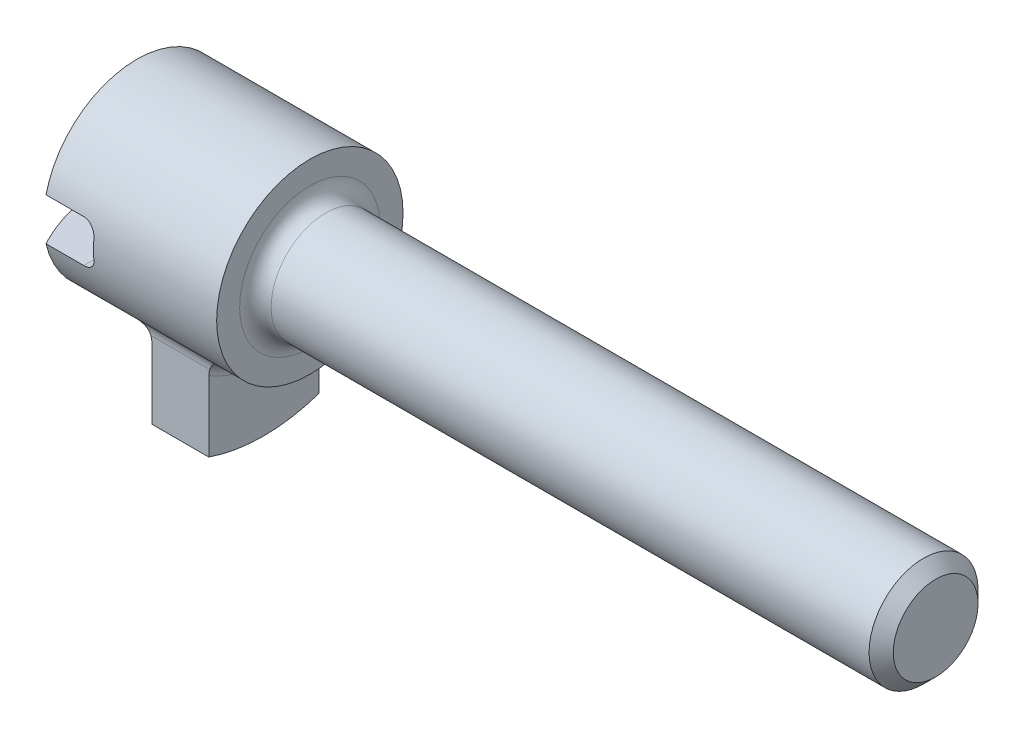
ISO-10303-21;
HEADER;
FILE_DESCRIPTION(('STEP AP214'),'2;1');
FILE_NAME('part.step','',(''),(''),'','','');
FILE_SCHEMA(('AUTOMOTIVE_DESIGN { 1 0 10303 214 1 1 1 1 }'));
ENDSEC;
DATA;
#1=APPLICATION_CONTEXT('core data for automotive mechanical design processes');
#2=APPLICATION_PROTOCOL_DEFINITION('international standard','automotive_design',2000,#1);
#3=PRODUCT_CONTEXT('',#1,'mechanical');
#4=PRODUCT('Part','Part','',(#3));
#5=PRODUCT_RELATED_PRODUCT_CATEGORY('part','',(#4));
#6=PRODUCT_DEFINITION_FORMATION('','',#4);
#7=PRODUCT_DEFINITION_CONTEXT('part definition',#1,'design');
#8=PRODUCT_DEFINITION('design','',#6,#7);
#9=PRODUCT_DEFINITION_SHAPE('','',#8);
#10=(LENGTH_UNIT() NAMED_UNIT(*) SI_UNIT(.MILLI.,.METRE.));
#11=(NAMED_UNIT(*) PLANE_ANGLE_UNIT() SI_UNIT($,.RADIAN.));
#12=(NAMED_UNIT(*) SI_UNIT($,.STERADIAN.) SOLID_ANGLE_UNIT());
#13=UNCERTAINTY_MEASURE_WITH_UNIT(LENGTH_MEASURE(1.E-05),#10,'distance_accuracy_value','');
#14=(GEOMETRIC_REPRESENTATION_CONTEXT(3) GLOBAL_UNCERTAINTY_ASSIGNED_CONTEXT((#13)) GLOBAL_UNIT_ASSIGNED_CONTEXT((#10,
#11,#12)) REPRESENTATION_CONTEXT('',''));
#15=CARTESIAN_POINT('',(0.,0.,0.));
#16=DIRECTION('',(0.,0.,1.));
#17=DIRECTION('',(1.,0.,0.));
#18=AXIS2_PLACEMENT_3D('',#15,#16,#17);
#19=CARTESIAN_POINT('',(1.4732,0.,1.1557));
#20=DIRECTION('',(1.,0.,0.));
#21=DIRECTION('',(0.,1.,0.));
#22=AXIS2_PLACEMENT_3D('',#19,#20,#21);
#23=PLANE('',#22);
#24=DIRECTION('',(0.,-1.,0.));
#25=VECTOR('',#24,1.);
#26=CARTESIAN_POINT('',(1.4732,0.,1.1557));
#27=LINE('',#26,#25);
#28=CARTESIAN_POINT('',(1.4732,-1.88350034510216,1.1557));
#29=VERTEX_POINT('',#28);
#30=CARTESIAN_POINT('',(1.4732,-3.36295904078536,1.1557));
#31=VERTEX_POINT('',#30);
#32=EDGE_CURVE('E137',#29,#31,#27,.T.);
#33=ORIENTED_EDGE('',*,*,#32,.F.);
#34=CARTESIAN_POINT('',(1.4732,0.,0.));
#35=DIRECTION('',(1.,0.,0.));
#36=DIRECTION('',(0.,1.,0.));
#37=AXIS2_PLACEMENT_3D('',#34,#35,#36);
#38=CIRCLE('',#37,2.20979999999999);
#39=CARTESIAN_POINT('',(1.4732,-1.88350034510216,-1.1557));
#40=VERTEX_POINT('',#39);
#41=EDGE_CURVE('E181',#29,#40,#38,.T.);
#42=ORIENTED_EDGE('',*,*,#41,.T.);
#43=DIRECTION('',(0.,-1.,0.));
#44=VECTOR('',#43,1.);
#45=CARTESIAN_POINT('',(1.4732,0.,-1.1557));
#46=LINE('',#45,#44);
#47=CARTESIAN_POINT('',(1.4732,-3.36295904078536,-1.1557));
#48=VERTEX_POINT('',#47);
#49=EDGE_CURVE('E154',#40,#48,#46,.T.);
#50=ORIENTED_EDGE('',*,*,#49,.T.);
#51=CARTESIAN_POINT('',(1.4732,0.,0.));
#52=DIRECTION('',(-1.,0.,0.));
#53=DIRECTION('',(0.,-1.,0.));
#54=AXIS2_PLACEMENT_3D('',#51,#52,#53);
#55=CIRCLE('',#54,3.556);
#56=EDGE_CURVE('E152',#48,#31,#55,.T.);
#57=ORIENTED_EDGE('',*,*,#56,.T.);
#58=EDGE_LOOP('',(#33,#42,#50,#57));
#59=FACE_BOUND('',#58,.T.);
#60=ADVANCED_FACE('F32',(#59),#23,.F.);
#61=CARTESIAN_POINT('',(2.667,-3.556,1.1557));
#62=DIRECTION('',(-1.,0.,0.));
#63=DIRECTION('',(0.,0.,1.));
#64=AXIS2_PLACEMENT_3D('',#61,#62,#63);
#65=PLANE('',#64);
#66=DIRECTION('',(0.,1.,0.));
#67=VECTOR('',#66,1.);
#68=CARTESIAN_POINT('',(2.667,-3.556,-1.1557));
#69=LINE('',#68,#67);
#70=CARTESIAN_POINT('',(2.667,-3.36295904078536,-1.1557));
#71=VERTEX_POINT('',#70);
#72=CARTESIAN_POINT('',(2.667,-1.88350034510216,-1.1557));
#73=VERTEX_POINT('',#72);
#74=EDGE_CURVE('E149',#71,#73,#69,.T.);
#75=ORIENTED_EDGE('',*,*,#74,.T.);
#76=CARTESIAN_POINT('',(2.667,0.,0.));
#77=DIRECTION('',(-1.,0.,0.));
#78=DIRECTION('',(0.,0.,1.));
#79=AXIS2_PLACEMENT_3D('',#76,#77,#78);
#80=CIRCLE('',#79,2.20979999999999);
#81=CARTESIAN_POINT('',(2.667,-1.88350034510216,1.1557));
#82=VERTEX_POINT('',#81);
#83=EDGE_CURVE('E179',#73,#82,#80,.T.);
#84=ORIENTED_EDGE('',*,*,#83,.T.);
#85=DIRECTION('',(0.,1.,0.));
#86=VECTOR('',#85,1.);
#87=CARTESIAN_POINT('',(2.667,-3.556,1.1557));
#88=LINE('',#87,#86);
#89=CARTESIAN_POINT('',(2.667,-3.36295904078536,1.1557));
#90=VERTEX_POINT('',#89);
#91=EDGE_CURVE('E148',#90,#82,#88,.T.);
#92=ORIENTED_EDGE('',*,*,#91,.F.);
#93=CARTESIAN_POINT('',(2.667,0.,0.));
#94=DIRECTION('',(-1.,0.,0.));
#95=DIRECTION('',(0.,0.,1.));
#96=AXIS2_PLACEMENT_3D('',#93,#94,#95);
#97=CIRCLE('',#96,3.556);
#98=EDGE_CURVE('E157',#71,#90,#97,.T.);
#99=ORIENTED_EDGE('',*,*,#98,.F.);
#100=EDGE_LOOP('',(#75,#84,#92,#99));
#101=FACE_BOUND('',#100,.T.);
#102=ADVANCED_FACE('F231',(#101),#65,.F.);
#103=CARTESIAN_POINT('',(1.4732,0.,1.1557));
#104=DIRECTION('',(0.,0.,1.));
#105=DIRECTION('',(1.,0.,0.));
#106=AXIS2_PLACEMENT_3D('',#103,#104,#105);
#107=PLANE('',#106);
#108=ORIENTED_EDGE('',*,*,#91,.T.);
#109=CARTESIAN_POINT('',(2.667,-1.88350034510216,1.1557));
#110=CARTESIAN_POINT('',(2.6670296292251,-1.86232699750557,1.1557));
#111=CARTESIAN_POINT('',(2.66889647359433,-1.84148543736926,1.1557));
#112=CARTESIAN_POINT('',(2.67630402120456,-1.80046905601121,1.1557));
#113=CARTESIAN_POINT('',(2.68184415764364,-1.78029413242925,1.1557));
#114=CARTESIAN_POINT('',(2.68922094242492,-1.76045089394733,1.1557));
#115=B_SPLINE_CURVE_WITH_KNOTS('',3,(#109,#110,#111,#112,#113,#114),.UNSPECIFIED.,.F.,.F.,(4,2,
4),(0.,0.0627750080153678,0.125540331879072),.UNSPECIFIED.);
#116=CARTESIAN_POINT('',(2.68922094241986,-1.76045089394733,1.1557));
#117=VERTEX_POINT('',#116);
#118=EDGE_CURVE('E235',#82,#117,#115,.T.);
#119=ORIENTED_EDGE('',*,*,#118,.T.);
#120=DIRECTION('',(1.,0.,0.));
#121=VECTOR('',#120,1.);
#122=CARTESIAN_POINT('',(1.4732,-1.76045089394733,1.1557));
#123=LINE('',#122,#121);
#124=CARTESIAN_POINT('',(1.45097905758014,-1.76045089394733,1.1557));
#125=VERTEX_POINT('',#124);
#126=EDGE_CURVE('E59',#117,#125,#123,.F.);
#127=ORIENTED_EDGE('',*,*,#126,.T.);
#128=CARTESIAN_POINT('',(1.45097905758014,-1.76045089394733,1.1557));
#129=CARTESIAN_POINT('',(1.45835584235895,-1.78029413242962,1.1557));
#130=CARTESIAN_POINT('',(1.46389597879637,-1.80046905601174,1.1557));
#131=CARTESIAN_POINT('',(1.47130352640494,-1.84148543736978,1.1557));
#132=CARTESIAN_POINT('',(1.47317037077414,-1.86232699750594,1.1557));
#133=CARTESIAN_POINT('',(1.4732,-1.88350034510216,1.1557));
#134=B_SPLINE_CURVE_WITH_KNOTS('',3,(#128,#129,#130,#131,#132,#133),.UNSPECIFIED.,.F.,.F.,(4,2,
4),(0.,0.0627653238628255,0.125540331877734),.UNSPECIFIED.);
#135=EDGE_CURVE('E145',#125,#29,#134,.T.);
#136=ORIENTED_EDGE('',*,*,#135,.T.);
#137=ORIENTED_EDGE('',*,*,#32,.T.);
#138=DIRECTION('',(-1.,0.,0.));
#139=VECTOR('',#138,1.);
#140=CARTESIAN_POINT('',(16.764,-3.36295904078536,1.1557));
#141=LINE('',#140,#139);
#142=EDGE_CURVE('E142',#31,#90,#141,.F.);
#143=ORIENTED_EDGE('',*,*,#142,.T.);
#144=EDGE_LOOP('',(#108,#119,#127,#136,#137,#143));
#145=FACE_BOUND('',#144,.T.);
#146=ADVANCED_FACE('F140',(#145),#107,.T.);
#147=CARTESIAN_POINT('',(1.4732,0.,-1.1557));
#148=DIRECTION('',(0.,0.,1.));
#149=DIRECTION('',(1.,0.,0.));
#150=AXIS2_PLACEMENT_3D('',#147,#148,#149);
#151=PLANE('',#150);
#152=ORIENTED_EDGE('',*,*,#49,.F.);
#153=CARTESIAN_POINT('',(1.4732,-1.88350034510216,-1.1557));
#154=CARTESIAN_POINT('',(1.4731703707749,-1.86232699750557,-1.1557));
#155=CARTESIAN_POINT('',(1.47130352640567,-1.84148543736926,-1.1557));
#156=CARTESIAN_POINT('',(1.46389597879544,-1.80046905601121,-1.1557));
#157=CARTESIAN_POINT('',(1.45835584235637,-1.78029413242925,-1.1557));
#158=CARTESIAN_POINT('',(1.45097905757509,-1.76045089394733,-1.1557));
#159=B_SPLINE_CURVE_WITH_KNOTS('',3,(#153,#154,#155,#156,#157,#158),.UNSPECIFIED.,.F.,.F.,(4,2,
4),(0.,0.0627750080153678,0.125540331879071),.UNSPECIFIED.);
#160=CARTESIAN_POINT('',(1.45097905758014,-1.76045089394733,-1.1557));
#161=VERTEX_POINT('',#160);
#162=EDGE_CURVE('E45',#40,#161,#159,.T.);
#163=ORIENTED_EDGE('',*,*,#162,.T.);
#164=DIRECTION('',(-1.,0.,0.));
#165=VECTOR('',#164,1.);
#166=CARTESIAN_POINT('',(1.4732,-1.76045089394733,-1.1557));
#167=LINE('',#166,#165);
#168=CARTESIAN_POINT('',(2.68922094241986,-1.76045089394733,-1.1557));
#169=VERTEX_POINT('',#168);
#170=EDGE_CURVE('E51',#161,#169,#167,.F.);
#171=ORIENTED_EDGE('',*,*,#170,.T.);
#172=CARTESIAN_POINT('',(2.68922094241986,-1.76045089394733,-1.1557));
#173=CARTESIAN_POINT('',(2.68184415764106,-1.78029413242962,-1.1557));
#174=CARTESIAN_POINT('',(2.67630402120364,-1.80046905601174,-1.1557));
#175=CARTESIAN_POINT('',(2.66889647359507,-1.84148543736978,-1.1557));
#176=CARTESIAN_POINT('',(2.66702962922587,-1.86232699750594,-1.1557));
#177=CARTESIAN_POINT('',(2.667,-1.88350034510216,-1.1557));
#178=B_SPLINE_CURVE_WITH_KNOTS('',3,(#172,#173,#174,#175,#176,#177),.UNSPECIFIED.,.F.,.F.,(4,2,
4),(0.,0.0627653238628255,0.125540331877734),.UNSPECIFIED.);
#179=EDGE_CURVE('E188',#169,#73,#178,.T.);
#180=ORIENTED_EDGE('',*,*,#179,.T.);
#181=ORIENTED_EDGE('',*,*,#74,.F.);
#182=DIRECTION('',(-1.,0.,0.));
#183=VECTOR('',#182,1.);
#184=CARTESIAN_POINT('',(16.764,-3.36295904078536,-1.1557));
#185=LINE('',#184,#183);
#186=EDGE_CURVE('E162',#48,#71,#185,.F.);
#187=ORIENTED_EDGE('',*,*,#186,.F.);
#188=EDGE_LOOP('',(#152,#163,#171,#180,#181,#187));
#189=FACE_BOUND('',#188,.T.);
#190=ADVANCED_FACE('F230',(#189),#151,.F.);
#191=CARTESIAN_POINT('',(3.56243489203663,0.,0.));
#192=DIRECTION('',(-1.,0.,0.));
#193=DIRECTION('',(0.,1.,0.));
#194=AXIS2_PLACEMENT_3D('',#191,#192,#193);
#195=SPHERICAL_SURFACE('',#194,4.064);
#196=CARTESIAN_POINT('',(0.,0.,0.));
#197=DIRECTION('',(-1.,0.,0.));
#198=DIRECTION('',(0.,0.,1.));
#199=AXIS2_PLACEMENT_3D('',#196,#197,#198);
#200=CIRCLE('',#199,1.95579999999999);
#201=CARTESIAN_POINT('',(0.,0.4445,1.90461896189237));
#202=VERTEX_POINT('',#201);
#203=CARTESIAN_POINT('',(0.,0.4445,-1.90461896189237));
#204=VERTEX_POINT('',#203);
#205=EDGE_CURVE('E288',#202,#204,#200,.T.);
#206=ORIENTED_EDGE('',*,*,#205,.T.);
#207=CARTESIAN_POINT('',(3.56243489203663,0.4445,0.));
#208=DIRECTION('',(0.,1.,0.));
#209=DIRECTION('',(0.,0.,1.));
#210=AXIS2_PLACEMENT_3D('',#207,#208,#209);
#211=CIRCLE('',#210,4.0396182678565);
#212=EDGE_CURVE('E303',#204,#202,#211,.T.);
#213=ORIENTED_EDGE('',*,*,#212,.T.);
#214=EDGE_LOOP('',(#206,#213));
#215=FACE_BOUND('',#214,.T.);
#216=ADVANCED_FACE('F366',(#215),#195,.T.);
#217=CARTESIAN_POINT('',(6.1005094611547E-12,0.,0.));
#218=DIRECTION('',(-1.,0.,0.));
#219=DIRECTION('',(0.,0.,1.));
#220=AXIS2_PLACEMENT_3D('',#217,#218,#219);
#221=CYLINDRICAL_SURFACE('',#220,1.14299999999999);
#222=CARTESIAN_POINT('',(16.51,0.,0.));
#223=DIRECTION('',(-1.,0.,0.));
#224=DIRECTION('',(0.,0.,1.));
#225=AXIS2_PLACEMENT_3D('',#222,#223,#224);
#226=CIRCLE('',#225,1.14299999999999);
#227=CARTESIAN_POINT('',(16.51,0.,1.14299999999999));
#228=VERTEX_POINT('',#227);
#229=EDGE_CURVE('E281',#228,#228,#226,.T.);
#230=ORIENTED_EDGE('',*,*,#229,.T.);
#231=EDGE_LOOP('',(#230));
#232=FACE_BOUND('',#231,.T.);
#233=CARTESIAN_POINT('',(3.96240000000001,0.,0.));
#234=DIRECTION('',(-1.,0.,0.));
#235=DIRECTION('',(0.,0.,1.));
#236=AXIS2_PLACEMENT_3D('',#233,#234,#235);
#237=CIRCLE('',#236,1.14299999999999);
#238=CARTESIAN_POINT('',(3.96240000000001,0.,1.14299999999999));
#239=VERTEX_POINT('',#238);
#240=EDGE_CURVE('E297',#239,#239,#237,.T.);
#241=ORIENTED_EDGE('',*,*,#240,.F.);
#242=EDGE_LOOP('',(#241));
#243=FACE_BOUND('',#242,.T.);
#244=ADVANCED_FACE('F202',(#232,#243),#221,.T.);
#245=CARTESIAN_POINT('',(3.9624,0.,0.));
#246=DIRECTION('',(-1.,0.,0.));
#247=DIRECTION('',(0.,0.,1.));
#248=AXIS2_PLACEMENT_3D('',#245,#246,#247);
#249=TOROIDAL_SURFACE('',#248,1.47319999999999,0.3302);
#250=CARTESIAN_POINT('',(3.6322,0.,0.));
#251=DIRECTION('',(-1.,0.,0.));
#252=DIRECTION('',(0.,0.,1.));
#253=AXIS2_PLACEMENT_3D('',#250,#251,#252);
#254=CIRCLE('',#253,1.4732);
#255=CARTESIAN_POINT('',(3.6322,0.,1.4732));
#256=VERTEX_POINT('',#255);
#257=EDGE_CURVE('E294',#256,#256,#254,.T.);
#258=ORIENTED_EDGE('',*,*,#257,.F.);
#259=EDGE_LOOP('',(#258));
#260=FACE_BOUND('',#259,.T.);
#261=ORIENTED_EDGE('',*,*,#240,.T.);
#262=EDGE_LOOP('',(#261));
#263=FACE_BOUND('',#262,.T.);
#264=ADVANCED_FACE('F382',(#260,#263),#249,.F.);
#265=CARTESIAN_POINT('',(3.6322,-12.6788666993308,0.));
#266=DIRECTION('',(1.,0.,0.));
#267=DIRECTION('',(0.,0.,-1.));
#268=AXIS2_PLACEMENT_3D('',#265,#266,#267);
#269=PLANE('',#268);
#270=ORIENTED_EDGE('',*,*,#257,.T.);
#271=EDGE_LOOP('',(#270));
#272=FACE_BOUND('',#271,.T.);
#273=CARTESIAN_POINT('',(3.6322,0.,0.));
#274=DIRECTION('',(-1.,0.,0.));
#275=DIRECTION('',(0.,0.,1.));
#276=AXIS2_PLACEMENT_3D('',#273,#274,#275);
#277=CIRCLE('',#276,1.95579999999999);
#278=CARTESIAN_POINT('',(3.6322,0.,1.95579999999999));
#279=VERTEX_POINT('',#278);
#280=EDGE_CURVE('E291',#279,#279,#277,.T.);
#281=ORIENTED_EDGE('',*,*,#280,.F.);
#282=EDGE_LOOP('',(#281));
#283=FACE_BOUND('',#282,.T.);
#284=ADVANCED_FACE('F389',(#272,#283),#269,.T.);
#285=CARTESIAN_POINT('',(6.1005094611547E-12,0.,0.));
#286=DIRECTION('',(-1.,0.,0.));
#287=DIRECTION('',(0.,0.,1.));
#288=AXIS2_PLACEMENT_3D('',#285,#286,#287);
#289=CYLINDRICAL_SURFACE('',#288,1.95579999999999);
#290=CARTESIAN_POINT('',(2.921,0.,0.));
#291=DIRECTION('',(-1.,0.,0.));
#292=DIRECTION('',(0.,0.,1.));
#293=AXIS2_PLACEMENT_3D('',#290,#291,#292);
#294=CIRCLE('',#293,1.95579999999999);
#295=CARTESIAN_POINT('',(2.921,-1.4734208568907,1.28615108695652));
#296=VERTEX_POINT('',#295);
#297=CARTESIAN_POINT('',(2.921,-1.4734208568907,-1.28615108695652));
#298=VERTEX_POINT('',#297);
#299=EDGE_CURVE('E176',#296,#298,#294,.F.);
#300=ORIENTED_EDGE('',*,*,#299,.T.);
#301=DIRECTION('',(-1.,0.,0.));
#302=VECTOR('',#301,1.);
#303=CARTESIAN_POINT('',(6.1005094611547E-12,-1.4734208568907,-1.28615108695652));
#304=LINE('',#303,#302);
#305=CARTESIAN_POINT('',(1.2192,-1.4734208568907,-1.28615108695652));
#306=VERTEX_POINT('',#305);
#307=EDGE_CURVE('E164',#298,#306,#304,.T.);
#308=ORIENTED_EDGE('',*,*,#307,.T.);
#309=CARTESIAN_POINT('',(1.2192,0.,0.));
#310=DIRECTION('',(1.,0.,0.));
#311=DIRECTION('',(0.,1.,0.));
#312=AXIS2_PLACEMENT_3D('',#309,#310,#311);
#313=CIRCLE('',#312,1.95579999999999);
#314=CARTESIAN_POINT('',(1.2192,-1.4734208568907,1.28615108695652));
#315=VERTEX_POINT('',#314);
#316=EDGE_CURVE('E173',#306,#315,#313,.F.);
#317=ORIENTED_EDGE('',*,*,#316,.T.);
#318=DIRECTION('',(-1.,0.,0.));
#319=VECTOR('',#318,1.);
#320=CARTESIAN_POINT('',(6.1005094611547E-12,-1.4734208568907,1.28615108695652));
#321=LINE('',#320,#319);
#322=EDGE_CURVE('E161',#315,#296,#321,.F.);
#323=ORIENTED_EDGE('',*,*,#322,.T.);
#324=EDGE_LOOP('',(#300,#308,#317,#323));
#325=FACE_BOUND('',#324,.T.);
#326=DIRECTION('',(-1.,0.,0.));
#327=VECTOR('',#326,1.);
#328=CARTESIAN_POINT('',(6.1005094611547E-12,0.4445,1.90461896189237));
#329=LINE('',#328,#327);
#330=CARTESIAN_POINT('',(0.79281662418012,0.4445,1.90461896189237));
#331=VERTEX_POINT('',#330);
#332=EDGE_CURVE('E277',#331,#202,#329,.T.);
#333=ORIENTED_EDGE('',*,*,#332,.F.);
#334=CARTESIAN_POINT('',(0.960821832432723,0.,1.95579999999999));
#335=CARTESIAN_POINT('',(0.971477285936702,0.00939799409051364,1.95579994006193));
#336=CARTESIAN_POINT('',(0.981348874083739,0.0196977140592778,1.95573207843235));
#337=CARTESIAN_POINT('',(0.999236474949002,0.0418076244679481,1.95538434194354));
#338=CARTESIAN_POINT('',(1.00725067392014,0.0536192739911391,1.95510426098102));
#339=CARTESIAN_POINT('',(1.02118713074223,0.0784065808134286,1.95426700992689));
#340=CARTESIAN_POINT('',(1.02710994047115,0.0913819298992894,1.95370991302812));
#341=CARTESIAN_POINT('',(1.0366997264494,0.118120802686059,1.95227564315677));
#342=CARTESIAN_POINT('',(1.04036720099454,0.131884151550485,1.95139854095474));
#343=CARTESIAN_POINT('',(1.04534941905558,0.159781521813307,1.94931238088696));
#344=CARTESIAN_POINT('',(1.04666808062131,0.173914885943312,1.94810387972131));
#345=CARTESIAN_POINT('',(1.04694143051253,0.202174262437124,1.9453741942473));
#346=CARTESIAN_POINT('',(1.04589596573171,0.216300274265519,1.94385298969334));
#347=CARTESIAN_POINT('',(1.04147109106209,0.244243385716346,1.94054067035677));
#348=CARTESIAN_POINT('',(1.03807668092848,0.258057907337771,1.9387478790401));
#349=CARTESIAN_POINT('',(1.02904502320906,0.284907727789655,1.93498454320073));
#350=CARTESIAN_POINT('',(1.02340757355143,0.297942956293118,1.93301398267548));
#351=CARTESIAN_POINT('',(1.00995795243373,0.323056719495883,1.92897695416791));
#352=CARTESIAN_POINT('',(1.00211721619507,0.335119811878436,1.92690954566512));
#353=CARTESIAN_POINT('',(0.984508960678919,0.357759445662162,1.92283497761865));
#354=CARTESIAN_POINT('',(0.974741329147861,0.368335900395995,1.9208278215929));
#355=CARTESIAN_POINT('',(0.953484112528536,0.387756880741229,1.91700206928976));
#356=CARTESIAN_POINT('',(0.941985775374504,0.396592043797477,1.91518451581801));
#357=CARTESIAN_POINT('',(0.91761972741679,0.412196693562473,1.91188686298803));
#358=CARTESIAN_POINT('',(0.904752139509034,0.418966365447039,1.91040673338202));
#359=CARTESIAN_POINT('',(0.878211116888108,0.43014143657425,1.90792150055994));
#360=CARTESIAN_POINT('',(0.86455245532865,0.434580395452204,1.90690968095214));
#361=CARTESIAN_POINT('',(0.836655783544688,0.441097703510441,1.9054127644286));
#362=CARTESIAN_POINT('',(0.822417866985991,0.443176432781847,1.90492758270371));
#363=CARTESIAN_POINT('',(0.794114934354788,0.444883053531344,1.90452971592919));
#364=CARTESIAN_POINT('',(0.78005337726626,0.444565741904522,1.904604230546));
#365=CARTESIAN_POINT('',(0.752188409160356,0.441620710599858,1.90528922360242));
#366=CARTESIAN_POINT('',(0.738384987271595,0.438993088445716,1.90589967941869));
#367=CARTESIAN_POINT('',(0.71150464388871,0.431534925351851,1.90760206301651));
#368=CARTESIAN_POINT('',(0.698424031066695,0.426717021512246,1.90869122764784));
#369=CARTESIAN_POINT('',(0.673256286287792,0.415030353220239,1.91126635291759));
#370=CARTESIAN_POINT('',(0.661169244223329,0.408161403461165,1.91275234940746));
#371=CARTESIAN_POINT('',(0.638099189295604,0.392432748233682,1.91604166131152));
#372=CARTESIAN_POINT('',(0.627139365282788,0.38354011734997,1.91785010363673));
#373=CARTESIAN_POINT('',(0.606853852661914,0.364084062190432,1.9216384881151));
#374=CARTESIAN_POINT('',(0.597528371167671,0.353520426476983,1.92361845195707));
#375=CARTESIAN_POINT('',(0.580570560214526,0.330761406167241,1.92766354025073));
#376=CARTESIAN_POINT('',(0.572978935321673,0.318535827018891,1.92972958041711));
#377=CARTESIAN_POINT('',(0.559960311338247,0.292968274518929,1.9337762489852));
#378=CARTESIAN_POINT('',(0.554533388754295,0.279626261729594,1.93575687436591));
#379=CARTESIAN_POINT('',(0.545984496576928,0.252128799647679,1.93953035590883));
#380=CARTESIAN_POINT('',(0.542873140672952,0.237969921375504,1.94132231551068));
#381=CARTESIAN_POINT('',(0.539100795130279,0.209296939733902,1.94462247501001));
#382=CARTESIAN_POINT('',(0.538439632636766,0.194782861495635,1.94613069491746));
#383=CARTESIAN_POINT('',(0.539596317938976,0.165993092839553,1.94879617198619));
#384=CARTESIAN_POINT('',(0.541385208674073,0.151716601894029,1.94995733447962));
#385=CARTESIAN_POINT('',(0.547352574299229,0.12364772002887,1.95193823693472));
#386=CARTESIAN_POINT('',(0.551530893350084,0.109855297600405,1.95275799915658));
#387=CARTESIAN_POINT('',(0.562103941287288,0.0833109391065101,1.95406953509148));
#388=CARTESIAN_POINT('',(0.568473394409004,0.0705491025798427,1.95456486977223));
#389=CARTESIAN_POINT('',(0.583259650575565,0.0462641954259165,1.95529052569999));
#390=CARTESIAN_POINT('',(0.591676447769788,0.0347411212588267,1.95552084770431));
#391=CARTESIAN_POINT('',(0.610309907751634,0.0132738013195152,1.95578444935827));
#392=CARTESIAN_POINT('',(0.620524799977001,0.00332802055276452,1.95581792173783));
#393=CARTESIAN_POINT('',(0.642472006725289,-0.0147177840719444,1.95576549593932));
#394=CARTESIAN_POINT('',(0.654204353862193,-0.02281776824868,1.95567959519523));
#395=CARTESIAN_POINT('',(0.678905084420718,-0.0369721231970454,1.95546342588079));
#396=CARTESIAN_POINT('',(0.691878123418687,-0.0430183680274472,1.95533298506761));
#397=CARTESIAN_POINT('',(0.718654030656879,-0.0528501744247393,1.95509202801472));
#398=CARTESIAN_POINT('',(0.732456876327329,-0.0566357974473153,1.95498151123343));
#399=CARTESIAN_POINT('',(0.760520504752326,-0.0618428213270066,1.95482377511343));
#400=CARTESIAN_POINT('',(0.77478185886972,-0.0632611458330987,1.95477663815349));
#401=CARTESIAN_POINT('',(0.803343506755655,-0.0636833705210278,1.95476293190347));
#402=CARTESIAN_POINT('',(0.817643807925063,-0.0626867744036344,1.95479637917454));
#403=CARTESIAN_POINT('',(0.845871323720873,-0.0583076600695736,1.95493186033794));
#404=CARTESIAN_POINT('',(0.859798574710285,-0.0549253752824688,1.95503388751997));
#405=CARTESIAN_POINT('',(0.886877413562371,-0.0458725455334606,1.95526716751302));
#406=CARTESIAN_POINT('',(0.900029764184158,-0.0402042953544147,1.95539839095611));
#407=CARTESIAN_POINT('',(0.921255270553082,-0.0288533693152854,1.95559256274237));
#408=CARTESIAN_POINT('',(0.929631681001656,-0.023728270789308,1.95566403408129));
#409=CARTESIAN_POINT('',(0.945737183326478,-0.0125453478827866,1.95576777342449));
#410=CARTESIAN_POINT('',(0.95346627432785,-0.00648752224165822,1.95580004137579));
#411=CARTESIAN_POINT('',(0.960821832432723,0.,1.95579999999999));
#412=B_SPLINE_CURVE_WITH_KNOTS('',3,(#334,#335,#336,#337,#338,#339,#340,#341,#342,#343,#344,
#345,#346,#347,#348,#349,#350,#351,#352,#353,#354,#355,#356,#357,#358,#359,#360,#361,#362,#363,
#364,#365,#366,#367,#368,#369,#370,#371,#372,#373,#374,#375,#376,#377,#378,#379,#380,#381,#382,
#383,#384,#385,#386,#387,#388,#389,#390,#391,#392,#393,#394,#395,#396,#397,#398,#399,#400,#401,
#402,#403,#404,#405,#406,#407,#408,#409,#410,#411),.UNSPECIFIED.,.T.,.F.,(4,2,2,2,2,2,2,2,2,2,2,
2,2,2,2,2,2,2,2,2,2,2,2,2,2,2,2,2,2,2,2,2,2,2,2,2,2,2,4),(0.,0.0425878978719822,
0.0852172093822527,0.127835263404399,0.17044389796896,0.212981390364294,0.255521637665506,
0.298336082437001,0.341154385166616,0.384555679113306,0.427959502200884,0.471590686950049,
0.515217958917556,0.558198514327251,0.601172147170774,0.643166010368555,0.685158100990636,
0.726910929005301,0.768667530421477,0.81115942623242,0.853656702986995,0.897067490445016,
0.94047981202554,0.984089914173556,1.02769693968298,1.07079299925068,1.11388624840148,
1.15649819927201,1.19911002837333,1.24168013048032,1.28425114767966,1.32698869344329,
1.36972507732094,1.41251695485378,1.45531762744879,1.49811411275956,1.54086774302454,
1.57026652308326,1.59966534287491),.UNSPECIFIED.);
#413=CARTESIAN_POINT('',(1.04681662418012,0.190499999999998,1.94650029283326));
#414=VERTEX_POINT('',#413);
#415=EDGE_CURVE('E166',#414,#331,#412,.T.);
#416=ORIENTED_EDGE('',*,*,#415,.F.);
#417=CARTESIAN_POINT('',(1.04681662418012,0.,0.));
#418=DIRECTION('',(1.,0.,0.));
#419=DIRECTION('',(0.,0.,-1.));
#420=AXIS2_PLACEMENT_3D('',#417,#418,#419);
#421=CIRCLE('',#420,1.95579999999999);
#422=CARTESIAN_POINT('',(1.04681662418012,-0.190499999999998,1.94650029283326));
#423=VERTEX_POINT('',#422);
#424=EDGE_CURVE('E333',#423,#414,#421,.F.);
#425=ORIENTED_EDGE('',*,*,#424,.F.);
#426=CARTESIAN_POINT('',(0.960821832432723,0.,1.95579999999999));
#427=CARTESIAN_POINT('',(0.950120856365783,0.00943658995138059,1.9558000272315));
#428=CARTESIAN_POINT('',(0.938616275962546,0.0179754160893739,1.95573174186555));
#429=CARTESIAN_POINT('',(0.914328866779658,0.0330064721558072,1.95553600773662));
#430=CARTESIAN_POINT('',(0.901544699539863,0.0394965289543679,1.95540849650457));
#431=CARTESIAN_POINT('',(0.875072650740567,0.0502359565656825,1.95516213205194));
#432=CARTESIAN_POINT('',(0.861385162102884,0.0544862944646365,1.95504327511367));
#433=CARTESIAN_POINT('',(0.833493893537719,0.060627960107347,1.9548625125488));
#434=CARTESIAN_POINT('',(0.819290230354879,0.0625198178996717,1.95480059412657));
#435=CARTESIAN_POINT('',(0.790765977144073,0.0638927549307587,1.9547562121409));
#436=CARTESIAN_POINT('',(0.776445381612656,0.063373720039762,1.95477375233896));
#437=CARTESIAN_POINT('',(0.748094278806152,0.059939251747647,1.95488204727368));
#438=CARTESIAN_POINT('',(0.73406378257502,0.0570237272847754,1.95497280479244));
#439=CARTESIAN_POINT('',(0.70669458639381,0.0488800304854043,1.95519329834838));
#440=CARTESIAN_POINT('',(0.693355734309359,0.043652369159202,1.95532302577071));
#441=CARTESIAN_POINT('',(0.667744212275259,0.0310326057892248,1.95556392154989));
#442=CARTESIAN_POINT('',(0.655471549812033,0.0236404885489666,1.95567508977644));
#443=CARTESIAN_POINT('',(0.632335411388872,0.00689748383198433,1.95580570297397));
#444=CARTESIAN_POINT('',(0.621472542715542,-0.00245424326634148,1.95582510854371));
#445=CARTESIAN_POINT('',(0.601471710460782,-0.0228482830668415,1.95569305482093));
#446=CARTESIAN_POINT('',(0.592333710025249,-0.0338905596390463,1.95554159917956));
#447=CARTESIAN_POINT('',(0.576062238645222,-0.0573215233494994,1.95499479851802));
#448=CARTESIAN_POINT('',(0.568924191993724,-0.0697070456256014,1.9546000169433));
#449=CARTESIAN_POINT('',(0.556826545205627,-0.0954873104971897,1.9535101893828));
#450=CARTESIAN_POINT('',(0.551866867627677,-0.108882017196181,1.95281515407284));
#451=CARTESIAN_POINT('',(0.544274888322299,-0.136242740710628,1.95109678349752));
#452=CARTESIAN_POINT('',(0.54163426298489,-0.150206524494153,1.95007464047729));
#453=CARTESIAN_POINT('',(0.538713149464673,-0.178350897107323,1.94770223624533));
#454=CARTESIAN_POINT('',(0.53843268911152,-0.192531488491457,1.94635197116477));
#455=CARTESIAN_POINT('',(0.540227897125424,-0.220759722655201,1.94335302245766));
#456=CARTESIAN_POINT('',(0.542311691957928,-0.234806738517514,1.94170332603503));
#457=CARTESIAN_POINT('',(0.548775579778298,-0.262332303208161,1.93817648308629));
#458=CARTESIAN_POINT('',(0.553155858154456,-0.275810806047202,1.93629931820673));
#459=CARTESIAN_POINT('',(0.564152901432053,-0.30200434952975,1.93238834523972));
#460=CARTESIAN_POINT('',(0.570797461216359,-0.314707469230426,1.93035284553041));
#461=CARTESIAN_POINT('',(0.586123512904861,-0.338817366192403,1.92626741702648));
#462=CARTESIAN_POINT('',(0.594805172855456,-0.350224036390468,1.92421748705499));
#463=CARTESIAN_POINT('',(0.61406409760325,-0.371529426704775,1.92021829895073));
#464=CARTESIAN_POINT('',(0.624658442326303,-0.381412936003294,1.91827017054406));
#465=CARTESIAN_POINT('',(0.647400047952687,-0.39925551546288,1.9146362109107));
#466=CARTESIAN_POINT('',(0.659547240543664,-0.407214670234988,1.91295036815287));
#467=CARTESIAN_POINT('',(0.684939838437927,-0.420901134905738,1.90998551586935));
#468=CARTESIAN_POINT('',(0.698174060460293,-0.42664838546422,1.90870289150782));
#469=CARTESIAN_POINT('',(0.72545840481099,-0.435828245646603,1.90662784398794));
#470=CARTESIAN_POINT('',(0.739508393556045,-0.439261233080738,1.90583534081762));
#471=CARTESIAN_POINT('',(0.767676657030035,-0.443645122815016,1.90481958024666));
#472=CARTESIAN_POINT('',(0.781785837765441,-0.444651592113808,1.90458358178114));
#473=CARTESIAN_POINT('',(0.809973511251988,-0.44431146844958,1.90466296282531));
#474=CARTESIAN_POINT('',(0.824052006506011,-0.442965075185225,1.9049782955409));
#475=CARTESIAN_POINT('',(0.85159712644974,-0.437996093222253,1.90612679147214));
#476=CARTESIAN_POINT('',(0.865069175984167,-0.434401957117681,1.9069534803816));
#477=CARTESIAN_POINT('',(0.891214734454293,-0.425077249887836,1.90905360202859));
#478=CARTESIAN_POINT('',(0.903888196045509,-0.419346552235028,1.91032706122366));
#479=CARTESIAN_POINT('',(0.928249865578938,-0.405837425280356,1.91324273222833));
#480=CARTESIAN_POINT('',(0.939924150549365,-0.398034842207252,1.91488925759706));
#481=CARTESIAN_POINT('',(0.961810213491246,-0.380638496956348,1.91842293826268));
#482=CARTESIAN_POINT('',(0.972021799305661,-0.371044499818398,1.92031012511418));
#483=CARTESIAN_POINT('',(0.990939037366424,-0.350084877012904,1.92424277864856));
#484=CARTESIAN_POINT('',(0.999604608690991,-0.338683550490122,1.92629088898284));
#485=CARTESIAN_POINT('',(1.01490253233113,-0.314586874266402,1.93037247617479));
#486=CARTESIAN_POINT('',(1.02153473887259,-0.301891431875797,1.93240595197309));
#487=CARTESIAN_POINT('',(1.03263773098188,-0.275411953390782,1.93635811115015));
#488=CARTESIAN_POINT('',(1.03708538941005,-0.261617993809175,1.93827538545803));
#489=CARTESIAN_POINT('',(1.04357663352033,-0.233445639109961,1.94186978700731));
#490=CARTESIAN_POINT('',(1.04562041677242,-0.219067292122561,1.94354693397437));
#491=CARTESIAN_POINT('',(1.04722216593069,-0.190264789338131,1.9465766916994));
#492=CARTESIAN_POINT('',(1.04680149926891,-0.175842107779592,1.94793198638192));
#493=CARTESIAN_POINT('',(1.04351990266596,-0.147245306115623,1.95030211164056));
#494=CARTESIAN_POINT('',(1.04065864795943,-0.133071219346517,1.95131689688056));
#495=CARTESIAN_POINT('',(1.03262001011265,-0.105570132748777,1.95299672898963));
#496=CARTESIAN_POINT('',(1.02747221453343,-0.0922347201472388,1.95366601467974));
#497=CARTESIAN_POINT('',(1.01501274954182,-0.0666155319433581,1.95470719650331));
#498=CARTESIAN_POINT('',(1.00770334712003,-0.054330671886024,1.95507940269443));
#499=CARTESIAN_POINT('',(0.993825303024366,-0.0349226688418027,1.95550394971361));
#500=CARTESIAN_POINT('',(0.987784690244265,-0.0274172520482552,1.95562086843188));
#501=CARTESIAN_POINT('',(0.974891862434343,-0.0131384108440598,1.95576888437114));
#502=CARTESIAN_POINT('',(0.968039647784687,-0.0063649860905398,1.95579998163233));
#503=CARTESIAN_POINT('',(0.960821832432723,0.,1.95579999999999));
#504=B_SPLINE_CURVE_WITH_KNOTS('',3,(#426,#427,#428,#429,#430,#431,#432,#433,#434,#435,#436,
#437,#438,#439,#440,#441,#442,#443,#444,#445,#446,#447,#448,#449,#450,#451,#452,#453,#454,#455,
#456,#457,#458,#459,#460,#461,#462,#463,#464,#465,#466,#467,#468,#469,#470,#471,#472,#473,#474,
#475,#476,#477,#478,#479,#480,#481,#482,#483,#484,#485,#486,#487,#488,#489,#490,#491,#492,#493,
#494,#495,#496,#497,#498,#499,#500,#501,#502,#503),.UNSPECIFIED.,.T.,.F.,(4,2,2,2,2,2,2,2,2,2,2,
2,2,2,2,2,2,2,2,2,2,2,2,2,2,2,2,2,2,2,2,2,2,2,2,2,2,2,4),(0.,0.0427673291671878,
0.0855798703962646,0.128373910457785,0.171158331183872,0.213944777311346,0.256732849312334,
0.299511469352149,0.342290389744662,0.3850876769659,0.427884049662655,0.470581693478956,
0.513277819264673,0.555820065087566,0.598362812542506,0.641052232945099,0.683745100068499,
0.726982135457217,0.770222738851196,0.813870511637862,0.857516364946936,0.900758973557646,
0.943994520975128,0.986230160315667,1.02846221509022,1.07017021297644,1.11188068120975,
1.15410055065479,1.19632596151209,1.23952346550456,1.28272406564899,1.32637265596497,
1.37001765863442,1.41328481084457,1.45655772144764,1.49928629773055,1.5419702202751,
1.5708168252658,1.59966341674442),.UNSPECIFIED.);
#505=CARTESIAN_POINT('',(0.79281662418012,-0.4445,1.90461896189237));
#506=VERTEX_POINT('',#505);
#507=EDGE_CURVE('E330',#506,#423,#504,.T.);
#508=ORIENTED_EDGE('',*,*,#507,.F.);
#509=DIRECTION('',(-1.,0.,0.));
#510=VECTOR('',#509,1.);
#511=CARTESIAN_POINT('',(6.1005094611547E-12,-0.4445,1.90461896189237));
#512=LINE('',#511,#510);
#513=CARTESIAN_POINT('',(0.,-0.4445,1.90461896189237));
#514=VERTEX_POINT('',#513);
#515=EDGE_CURVE('E275',#514,#506,#512,.F.);
#516=ORIENTED_EDGE('',*,*,#515,.F.);
#517=CARTESIAN_POINT('',(0.,-0.4445,-1.90461896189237));
#518=VERTEX_POINT('',#517);
#519=EDGE_CURVE('E287',#518,#514,#200,.T.);
#520=ORIENTED_EDGE('',*,*,#519,.F.);
#521=DIRECTION('',(-1.,0.,0.));
#522=VECTOR('',#521,1.);
#523=CARTESIAN_POINT('',(6.1005094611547E-12,-0.4445,-1.90461896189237));
#524=LINE('',#523,#522);
#525=CARTESIAN_POINT('',(0.79281662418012,-0.4445,-1.90461896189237));
#526=VERTEX_POINT('',#525);
#527=EDGE_CURVE('E264',#526,#518,#524,.T.);
#528=ORIENTED_EDGE('',*,*,#527,.F.);
#529=CARTESIAN_POINT('',(1.04681662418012,-0.1905,-1.94650029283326));
#530=CARTESIAN_POINT('',(1.04681599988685,-0.204865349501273,-1.94509416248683));
#531=CARTESIAN_POINT('',(1.04559383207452,-0.219224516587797,-1.94352681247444));
#532=CARTESIAN_POINT('',(1.04075219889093,-0.247511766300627,-1.94012762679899));
#533=CARTESIAN_POINT('',(1.03712990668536,-0.261439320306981,-1.93829548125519));
#534=CARTESIAN_POINT('',(1.02760628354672,-0.288452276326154,-1.93445984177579));
#535=CARTESIAN_POINT('',(1.02170713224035,-0.301538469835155,-1.9324565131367));
#536=CARTESIAN_POINT('',(1.00780019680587,-0.326523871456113,-1.92839213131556));
#537=CARTESIAN_POINT('',(0.999792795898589,-0.338423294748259,-1.92633108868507));
#538=CARTESIAN_POINT('',(0.981812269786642,-0.360806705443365,-1.922265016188));
#539=CARTESIAN_POINT('',(0.971823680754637,-0.371278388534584,-1.92026057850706));
#540=CARTESIAN_POINT('',(0.950191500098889,-0.390393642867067,-1.91646592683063));
#541=CARTESIAN_POINT('',(0.938547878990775,-0.399037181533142,-1.91467571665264));
#542=CARTESIAN_POINT('',(0.913993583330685,-0.414194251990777,-1.91145407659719));
#543=CARTESIAN_POINT('',(0.901090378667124,-0.420719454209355,-1.91002069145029));
#544=CARTESIAN_POINT('',(0.874327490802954,-0.431497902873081,-1.90761472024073));
#545=CARTESIAN_POINT('',(0.860467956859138,-0.435751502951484,-1.90664206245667));
#546=CARTESIAN_POINT('',(0.832516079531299,-0.44177635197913,-1.90525502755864));
#547=CARTESIAN_POINT('',(0.818435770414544,-0.443600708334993,-1.90482871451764));
#548=CARTESIAN_POINT('',(0.790162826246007,-0.444879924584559,-1.90453038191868));
#549=CARTESIAN_POINT('',(0.775970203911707,-0.444335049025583,-1.90465830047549));
#550=CARTESIAN_POINT('',(0.748114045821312,-0.440922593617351,-1.90545107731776));
#551=CARTESIAN_POINT('',(0.734445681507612,-0.438092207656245,-1.9061073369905));
#552=CARTESIAN_POINT('',(0.707784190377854,-0.430246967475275,-1.90789340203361));
#553=CARTESIAN_POINT('',(0.694791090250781,-0.425232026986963,-1.90902322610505));
#554=CARTESIAN_POINT('',(0.669725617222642,-0.413120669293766,-1.91168080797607));
#555=CARTESIAN_POINT('',(0.657661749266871,-0.406007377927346,-1.91321178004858));
#556=CARTESIAN_POINT('',(0.634888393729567,-0.389921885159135,-1.91655468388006));
#557=CARTESIAN_POINT('',(0.624179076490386,-0.38094945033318,-1.91836665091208));
#558=CARTESIAN_POINT('',(0.604158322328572,-0.361165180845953,-1.92219066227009));
#559=CARTESIAN_POINT('',(0.59488462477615,-0.350315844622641,-1.92420634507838));
#560=CARTESIAN_POINT('',(0.578282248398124,-0.327223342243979,-1.92826756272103));
#561=CARTESIAN_POINT('',(0.570953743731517,-0.314980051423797,-1.93031310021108));
#562=CARTESIAN_POINT('',(0.558355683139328,-0.289252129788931,-1.93433669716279));
#563=CARTESIAN_POINT('',(0.553115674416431,-0.27575280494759,-1.93631345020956));
#564=CARTESIAN_POINT('',(0.54499736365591,-0.24803390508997,-1.94005882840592));
#565=CARTESIAN_POINT('',(0.542118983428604,-0.233814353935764,-1.94182746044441));
#566=CARTESIAN_POINT('',(0.538831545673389,-0.2051456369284,-1.94506444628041));
#567=CARTESIAN_POINT('',(0.538407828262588,-0.190698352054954,-1.94653453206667));
#568=CARTESIAN_POINT('',(0.540019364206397,-0.161911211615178,-1.94914012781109));
#569=CARTESIAN_POINT('',(0.542054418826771,-0.147571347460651,-1.95027566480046));
#570=CARTESIAN_POINT('',(0.548492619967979,-0.119614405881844,-1.9521884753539));
#571=CARTESIAN_POINT('',(0.552863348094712,-0.105990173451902,-1.95297038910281));
#572=CARTESIAN_POINT('',(0.563834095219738,-0.0796557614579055,-1.95422171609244));
#573=CARTESIAN_POINT('',(0.570434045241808,-0.0669455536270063,-1.95469113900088));
#574=CARTESIAN_POINT('',(0.585633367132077,-0.0428770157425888,-1.95536686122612));
#575=CARTESIAN_POINT('',(0.594221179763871,-0.0315114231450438,-1.95557463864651));
#576=CARTESIAN_POINT('',(0.613174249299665,-0.0103718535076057,-1.95580112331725));
#577=CARTESIAN_POINT('',(0.623539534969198,-0.000597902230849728,-1.95581982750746));
#578=CARTESIAN_POINT('',(0.645787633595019,0.0171082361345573,-1.95574532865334));
#579=CARTESIAN_POINT('',(0.657674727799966,0.0250350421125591,-1.95565180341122));
#580=CARTESIAN_POINT('',(0.68260764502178,0.0387873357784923,-1.95542749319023));
#581=CARTESIAN_POINT('',(0.695653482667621,0.0446127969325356,-1.9552967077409));
#582=CARTESIAN_POINT('',(0.722576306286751,0.0540121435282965,-1.95505975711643));
#583=CARTESIAN_POINT('',(0.736455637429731,0.0575793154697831,-1.9549536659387));
#584=CARTESIAN_POINT('',(0.764616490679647,0.062333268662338,-1.95480790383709));
#585=CARTESIAN_POINT('',(0.778898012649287,0.0635200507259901,-1.95476823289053));
#586=CARTESIAN_POINT('',(0.807455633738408,0.0634794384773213,-1.95476955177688));
#587=CARTESIAN_POINT('',(0.821731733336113,0.0622523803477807,-1.95481053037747));
#588=CARTESIAN_POINT('',(0.849875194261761,0.0574196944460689,-1.95495840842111));
#589=CARTESIAN_POINT('',(0.863742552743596,0.0538140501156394,-1.95506530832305));
#590=CARTESIAN_POINT('',(0.890675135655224,0.0443266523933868,-1.95530333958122));
#591=CARTESIAN_POINT('',(0.903740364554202,0.0384449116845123,-1.95543447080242));
#592=CARTESIAN_POINT('',(0.928698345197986,0.0245720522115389,-1.95565788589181));
#593=CARTESIAN_POINT('',(0.940591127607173,0.0165809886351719,-1.95575017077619));
#594=CARTESIAN_POINT('',(0.962868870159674,-0.00128544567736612,-1.95581992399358));
#595=CARTESIAN_POINT('',(0.973253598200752,-0.0111611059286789,-1.95579737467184));
#596=CARTESIAN_POINT('',(0.992218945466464,-0.0325169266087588,-1.95555875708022));
#597=CARTESIAN_POINT('',(1.00079922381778,-0.043997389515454,-1.95534265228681));
#598=CARTESIAN_POINT('',(1.01588976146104,-0.0681997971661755,-1.9546479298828));
#599=CARTESIAN_POINT('',(1.02240493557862,-0.0809186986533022,-1.9541699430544));
#600=CARTESIAN_POINT('',(1.03320504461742,-0.107244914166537,-1.95290172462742));
#601=CARTESIAN_POINT('',(1.03749239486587,-0.120851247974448,-1.95211183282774));
#602=CARTESIAN_POINT('',(1.04267487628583,-0.143860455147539,-1.95052367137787));
#603=CARTESIAN_POINT('',(1.0442270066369,-0.153127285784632,-1.94981873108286));
#604=CARTESIAN_POINT('',(1.04629808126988,-0.171763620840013,-1.94826547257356));
#605=CARTESIAN_POINT('',(1.04681703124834,-0.181133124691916,-1.94741715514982));
#606=CARTESIAN_POINT('',(1.04681662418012,-0.1905,-1.94650029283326));
#607=B_SPLINE_CURVE_WITH_KNOTS('',3,(#529,#530,#531,#532,#533,#534,#535,#536,#537,#538,#539,
#540,#541,#542,#543,#544,#545,#546,#547,#548,#549,#550,#551,#552,#553,#554,#555,#556,#557,#558,
#559,#560,#561,#562,#563,#564,#565,#566,#567,#568,#569,#570,#571,#572,#573,#574,#575,#576,#577,
#578,#579,#580,#581,#582,#583,#584,#585,#586,#587,#588,#589,#590,#591,#592,#593,#594,#595,#596,
#597,#598,#599,#600,#601,#602,#603,#604,#605,#606),.UNSPECIFIED.,.T.,.F.,(4,2,2,2,2,2,2,2,2,2,2,
2,2,2,2,2,2,2,2,2,2,2,2,2,2,2,2,2,2,2,2,2,2,2,2,2,2,2,4),(0.,0.0432672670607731,
0.0865855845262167,0.129862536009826,0.17313162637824,0.216752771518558,0.260374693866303,
0.303752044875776,0.347122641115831,0.389528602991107,0.431929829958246,0.473654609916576,
0.515381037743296,0.557452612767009,0.599529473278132,0.642572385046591,0.685619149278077,
0.729254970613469,0.772889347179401,0.816262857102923,0.859632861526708,0.902415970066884,
0.945197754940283,0.987736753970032,1.0302764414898,1.07293854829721,1.11560119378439,
1.15839007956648,1.20117895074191,1.24396186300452,1.28674507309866,1.32952804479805,
1.37230989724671,1.41509832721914,1.45789483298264,1.50058870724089,1.54323619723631,
1.57144862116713,1.59966088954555),.UNSPECIFIED.);
#608=CARTESIAN_POINT('',(1.04681662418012,-0.190499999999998,-1.94650029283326));
#609=VERTEX_POINT('',#608);
#610=EDGE_CURVE('E306',#609,#526,#607,.T.);
#611=ORIENTED_EDGE('',*,*,#610,.F.);
#612=CARTESIAN_POINT('',(1.04681662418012,0.190499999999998,-1.94650029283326));
#613=VERTEX_POINT('',#612);
#614=EDGE_CURVE('E312',#613,#609,#421,.F.);
#615=ORIENTED_EDGE('',*,*,#614,.F.);
#616=CARTESIAN_POINT('',(1.04681662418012,0.1905,-1.94650029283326));
#617=CARTESIAN_POINT('',(1.04681606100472,0.176359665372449,-1.94788398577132));
#618=CARTESIAN_POINT('',(1.04563202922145,0.162196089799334,-1.94911317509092));
#619=CARTESIAN_POINT('',(1.04091187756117,0.134231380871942,-1.95123877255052));
#620=CARTESIAN_POINT('',(1.03737367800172,0.120430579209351,-1.9521348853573));
#621=CARTESIAN_POINT('',(1.02803605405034,0.0936007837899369,-1.95360513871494));
#622=CARTESIAN_POINT('',(1.02223717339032,0.0805716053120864,-1.95417935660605));
#623=CARTESIAN_POINT('',(1.00853984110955,0.0556611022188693,-1.95504757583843));
#624=CARTESIAN_POINT('',(1.00064173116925,0.0437795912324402,-1.95534162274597));
#625=CARTESIAN_POINT('',(0.982979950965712,0.0215161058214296,-1.95571335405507));
#626=CARTESIAN_POINT('',(0.973218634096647,0.0111322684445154,-1.95579130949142));
#627=CARTESIAN_POINT('',(0.952099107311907,-0.00786027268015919,-1.95580732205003));
#628=CARTESIAN_POINT('',(0.94074082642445,-0.0164688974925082,-1.95574537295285));
#629=CARTESIAN_POINT('',(0.916701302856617,-0.0316976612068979,-1.95555806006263));
#630=CARTESIAN_POINT('',(0.904015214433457,-0.0383101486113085,-1.95543245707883));
#631=CARTESIAN_POINT('',(0.877714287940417,-0.049315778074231,-1.95518594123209));
#632=CARTESIAN_POINT('',(0.864099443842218,-0.0537089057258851,-1.95506502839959));
#633=CARTESIAN_POINT('',(0.836299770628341,-0.060157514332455,-1.95487729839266));
#634=CARTESIAN_POINT('',(0.822113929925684,-0.0622086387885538,-1.95481058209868));
#635=CARTESIAN_POINT('',(0.793599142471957,-0.0639000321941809,-1.95475603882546));
#636=CARTESIAN_POINT('',(0.779270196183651,-0.063540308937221,-1.9547682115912));
#637=CARTESIAN_POINT('',(0.750883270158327,-0.0604210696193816,-1.95486708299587));
#638=CARTESIAN_POINT('',(0.736825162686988,-0.057662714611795,-1.95495374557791));
#639=CARTESIAN_POINT('',(0.709371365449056,-0.049826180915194,-1.95516910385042));
#640=CARTESIAN_POINT('',(0.695975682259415,-0.0447479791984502,-1.95529779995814));
#641=CARTESIAN_POINT('',(0.670221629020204,-0.0324134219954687,-1.9555410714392));
#642=CARTESIAN_POINT('',(0.657863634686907,-0.0251562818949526,-1.95565564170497));
#643=CARTESIAN_POINT('',(0.634540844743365,-0.00867005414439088,-1.9557980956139));
#644=CARTESIAN_POINT('',(0.623576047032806,0.000559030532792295,-1.95582597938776));
#645=CARTESIAN_POINT('',(0.603356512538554,0.0207218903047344,-1.95571613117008));
#646=CARTESIAN_POINT('',(0.594100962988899,0.0316548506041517,-1.95557847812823));
#647=CARTESIAN_POINT('',(0.577557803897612,0.0549149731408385,-1.95506344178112));
#648=CARTESIAN_POINT('',(0.570270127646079,0.067242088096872,-1.95468606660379));
#649=CARTESIAN_POINT('',(0.557892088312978,0.0928863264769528,-1.95363498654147));
#650=CARTESIAN_POINT('',(0.552793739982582,0.106199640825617,-1.95296237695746));
#651=CARTESIAN_POINT('',(0.54489479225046,0.13347111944,-1.95128818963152));
#652=CARTESIAN_POINT('',(0.542094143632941,0.147429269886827,-1.95028661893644));
#653=CARTESIAN_POINT('',(0.538861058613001,0.175570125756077,-1.94795477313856));
#654=CARTESIAN_POINT('',(0.53842539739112,0.18975249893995,-1.94662494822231));
#655=CARTESIAN_POINT('',(0.539910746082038,0.217961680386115,-1.943668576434));
#656=CARTESIAN_POINT('',(0.541831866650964,0.231988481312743,-1.94204201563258));
#657=CARTESIAN_POINT('',(0.547988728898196,0.259618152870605,-1.93854266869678));
#658=CARTESIAN_POINT('',(0.552243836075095,0.273216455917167,-1.93666792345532));
#659=CARTESIAN_POINT('',(0.56295327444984,0.299496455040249,-1.93277835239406));
#660=CARTESIAN_POINT('',(0.569407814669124,0.312178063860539,-1.93076351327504));
#661=CARTESIAN_POINT('',(0.58443853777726,0.336448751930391,-1.92668354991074));
#662=CARTESIAN_POINT('',(0.593042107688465,0.348020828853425,-1.92461811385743));
#663=CARTESIAN_POINT('',(0.612092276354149,0.369556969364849,-1.92059926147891));
#664=CARTESIAN_POINT('',(0.6225389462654,0.37952097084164,-1.91864584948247));
#665=CARTESIAN_POINT('',(0.645015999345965,0.397572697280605,-1.91498689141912));
#666=CARTESIAN_POINT('',(0.657049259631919,0.405656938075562,-1.91328180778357));
#667=CARTESIAN_POINT('',(0.682351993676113,0.419678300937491,-1.91025533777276));
#668=CARTESIAN_POINT('',(0.695621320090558,0.425615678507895,-1.90893390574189));
#669=CARTESIAN_POINT('',(0.722767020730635,0.435064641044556,-1.90680245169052));
#670=CARTESIAN_POINT('',(0.736628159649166,0.438617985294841,-1.90598364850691));
#671=CARTESIAN_POINT('',(0.76477036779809,0.443349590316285,-1.90488866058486));
#672=CARTESIAN_POINT('',(0.77905137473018,0.444528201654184,-1.90461239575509));
#673=CARTESIAN_POINT('',(0.807302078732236,0.44447137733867,-1.90462562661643));
#674=CARTESIAN_POINT('',(0.821271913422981,0.443286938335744,-1.90490317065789));
#675=CARTESIAN_POINT('',(0.848807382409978,0.438645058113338,-1.90597737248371));
#676=CARTESIAN_POINT('',(0.862373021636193,0.435187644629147,-1.90677402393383));
#677=CARTESIAN_POINT('',(0.888710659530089,0.426114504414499,-1.90882201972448));
#678=CARTESIAN_POINT('',(0.901483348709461,0.420500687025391,-1.91007296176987));
#679=CARTESIAN_POINT('',(0.925909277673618,0.407283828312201,-1.91293467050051));
#680=CARTESIAN_POINT('',(0.937562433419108,0.399680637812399,-1.91454546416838));
#681=CARTESIAN_POINT('',(0.95967332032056,0.382527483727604,-1.91804700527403));
#682=CARTESIAN_POINT('',(0.970102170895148,0.372941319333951,-1.91994274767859));
#683=CARTESIAN_POINT('',(0.989218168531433,0.352183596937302,-1.92385854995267));
#684=CARTESIAN_POINT('',(0.997904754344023,0.341011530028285,-1.92587864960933));
#685=CARTESIAN_POINT('',(1.01345999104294,0.317146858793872,-1.92995357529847));
#686=CARTESIAN_POINT('',(1.02028908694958,0.304428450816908,-1.93200829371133));
#687=CARTESIAN_POINT('',(1.03169825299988,0.278011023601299,-1.93598586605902));
#688=CARTESIAN_POINT('',(1.03628055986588,0.264312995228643,-1.93790884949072));
#689=CARTESIAN_POINT('',(1.04203977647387,0.240550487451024,-1.94097567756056));
#690=CARTESIAN_POINT('',(1.04382710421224,0.230637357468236,-1.94217949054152));
#691=CARTESIAN_POINT('',(1.04621572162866,0.210653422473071,-1.94444848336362));
#692=CARTESIAN_POINT('',(1.04681702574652,0.200582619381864,-1.94551366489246));
#693=CARTESIAN_POINT('',(1.04681662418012,0.1905,-1.94650029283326));
#694=B_SPLINE_CURVE_WITH_KNOTS('',3,(#616,#617,#618,#619,#620,#621,#622,#623,#624,#625,#626,
#627,#628,#629,#630,#631,#632,#633,#634,#635,#636,#637,#638,#639,#640,#641,#642,#643,#644,#645,
#646,#647,#648,#649,#650,#651,#652,#653,#654,#655,#656,#657,#658,#659,#660,#661,#662,#663,#664,
#665,#666,#667,#668,#669,#670,#671,#672,#673,#674,#675,#676,#677,#678,#679,#680,#681,#682,#683,
#684,#685,#686,#687,#688,#689,#690,#691,#692,#693),.UNSPECIFIED.,.T.,.F.,(4,2,2,2,2,2,2,2,2,2,2,
2,2,2,2,2,2,2,2,2,2,2,2,2,2,2,2,2,2,2,2,2,2,2,2,2,2,2,4),(0.,0.0425872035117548,
0.085212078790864,0.127826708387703,0.170434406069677,0.212988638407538,0.255544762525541,
0.298261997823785,0.340979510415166,0.383776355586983,0.42657306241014,0.469349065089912,
0.512125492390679,0.554917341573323,0.597709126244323,0.640480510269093,0.683250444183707,
0.72586302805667,0.768474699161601,0.811028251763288,0.853583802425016,0.896497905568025,
0.939416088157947,0.982911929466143,1.02640945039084,1.06998696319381,1.11355928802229,
1.15634694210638,1.19912827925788,1.24099634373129,1.28286389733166,1.32469446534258,
1.36652817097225,1.40920636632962,1.45189828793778,1.49543855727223,1.53893539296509,
1.56930212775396,1.59966849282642),.UNSPECIFIED.);
#695=CARTESIAN_POINT('',(0.79281662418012,0.4445,-1.90461896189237));
#696=VERTEX_POINT('',#695);
#697=EDGE_CURVE('E334',#696,#613,#694,.T.);
#698=ORIENTED_EDGE('',*,*,#697,.F.);
#699=DIRECTION('',(-1.,0.,0.));
#700=VECTOR('',#699,1.);
#701=CARTESIAN_POINT('',(6.1005094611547E-12,0.4445,-1.90461896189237));
#702=LINE('',#701,#700);
#703=EDGE_CURVE('E279',#204,#696,#702,.F.);
#704=ORIENTED_EDGE('',*,*,#703,.F.);
#705=ORIENTED_EDGE('',*,*,#205,.F.);
#706=EDGE_LOOP('',(#333,#416,#425,#508,#516,#520,#528,#611,#615,#698,#704,#705));
#707=FACE_BOUND('',#706,.T.);
#708=ORIENTED_EDGE('',*,*,#280,.T.);
#709=EDGE_LOOP('',(#708));
#710=FACE_BOUND('',#709,.T.);
#711=ADVANCED_FACE('F314',(#325,#707,#710),#289,.T.);
#712=ORIENTED_EDGE('',*,*,#519,.T.);
#713=CARTESIAN_POINT('',(3.56243489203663,-0.4445,0.));
#714=DIRECTION('',(0.,-1.,0.));
#715=DIRECTION('',(0.,0.,-1.));
#716=AXIS2_PLACEMENT_3D('',#713,#714,#715);
#717=CIRCLE('',#716,4.0396182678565);
#718=EDGE_CURVE('E300',#514,#518,#717,.T.);
#719=ORIENTED_EDGE('',*,*,#718,.T.);
#720=EDGE_LOOP('',(#712,#719));
#721=FACE_BOUND('',#720,.T.);
#722=ADVANCED_FACE('F374',(#721),#195,.T.);
#723=CARTESIAN_POINT('',(16.764,-12.6788666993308,0.));
#724=DIRECTION('',(1.,0.,0.));
#725=DIRECTION('',(0.,0.,-1.));
#726=AXIS2_PLACEMENT_3D('',#723,#724,#725);
#727=PLANE('',#726);
#728=CARTESIAN_POINT('',(16.764,0.,0.));
#729=DIRECTION('',(-1.,0.,0.));
#730=DIRECTION('',(0.,0.,1.));
#731=AXIS2_PLACEMENT_3D('',#728,#729,#730);
#732=CIRCLE('',#731,0.888999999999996);
#733=CARTESIAN_POINT('',(16.764,0.,0.888999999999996));
#734=VERTEX_POINT('',#733);
#735=EDGE_CURVE('E284',#734,#734,#732,.T.);
#736=ORIENTED_EDGE('',*,*,#735,.F.);
#737=EDGE_LOOP('',(#736));
#738=FACE_BOUND('',#737,.T.);
#739=ADVANCED_FACE('F408',(#738),#727,.T.);
#740=CARTESIAN_POINT('',(16.51,0.,0.));
#741=DIRECTION('',(-1.,0.,0.));
#742=DIRECTION('',(0.,0.,1.));
#743=AXIS2_PLACEMENT_3D('',#740,#741,#742);
#744=CONICAL_SURFACE('',#743,1.14299999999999,0.785398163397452);
#745=ORIENTED_EDGE('',*,*,#735,.T.);
#746=EDGE_LOOP('',(#745));
#747=FACE_BOUND('',#746,.T.);
#748=ORIENTED_EDGE('',*,*,#229,.F.);
#749=EDGE_LOOP('',(#748));
#750=FACE_BOUND('',#749,.T.);
#751=ADVANCED_FACE('F348',(#747,#750),#744,.T.);
#752=CARTESIAN_POINT('',(-0.477183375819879,0.4445,-5.08));
#753=DIRECTION('',(0.,1.,0.));
#754=DIRECTION('',(0.,0.,1.));
#755=AXIS2_PLACEMENT_3D('',#752,#753,#754);
#756=PLANE('',#755);
#757=ORIENTED_EDGE('',*,*,#703,.T.);
#758=DIRECTION('',(0.,0.,1.));
#759=VECTOR('',#758,1.);
#760=CARTESIAN_POINT('',(0.79281662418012,0.4445,-5.08));
#761=LINE('',#760,#759);
#762=EDGE_CURVE('E261',#696,#331,#761,.T.);
#763=ORIENTED_EDGE('',*,*,#762,.T.);
#764=ORIENTED_EDGE('',*,*,#332,.T.);
#765=ORIENTED_EDGE('',*,*,#212,.F.);
#766=EDGE_LOOP('',(#757,#763,#764,#765));
#767=FACE_BOUND('',#766,.T.);
#768=ADVANCED_FACE('F343',(#767),#756,.F.);
#769=CARTESIAN_POINT('',(0.792816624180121,0.1905,-5.08));
#770=DIRECTION('',(0.,0.,1.));
#771=DIRECTION('',(1.,0.,0.));
#772=AXIS2_PLACEMENT_3D('',#769,#770,#771);
#773=CYLINDRICAL_SURFACE('',#772,0.254);
#774=ORIENTED_EDGE('',*,*,#415,.T.);
#775=ORIENTED_EDGE('',*,*,#762,.F.);
#776=ORIENTED_EDGE('',*,*,#697,.T.);
#777=DIRECTION('',(0.,0.,1.));
#778=VECTOR('',#777,1.);
#779=CARTESIAN_POINT('',(1.04681662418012,0.190499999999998,-5.08));
#780=LINE('',#779,#778);
#781=EDGE_CURVE('E265',#613,#414,#780,.T.);
#782=ORIENTED_EDGE('',*,*,#781,.T.);
#783=EDGE_LOOP('',(#774,#775,#776,#782));
#784=FACE_BOUND('',#783,.T.);
#785=ADVANCED_FACE('F339',(#784),#773,.F.);
#786=CARTESIAN_POINT('',(1.04681662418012,0.190499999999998,-5.08));
#787=DIRECTION('',(1.,0.,0.));
#788=DIRECTION('',(0.,0.,-1.));
#789=AXIS2_PLACEMENT_3D('',#786,#787,#788);
#790=PLANE('',#789);
#791=ORIENTED_EDGE('',*,*,#424,.T.);
#792=ORIENTED_EDGE('',*,*,#781,.F.);
#793=ORIENTED_EDGE('',*,*,#614,.T.);
#794=DIRECTION('',(0.,0.,1.));
#795=VECTOR('',#794,1.);
#796=CARTESIAN_POINT('',(1.04681662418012,-0.190499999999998,-5.08));
#797=LINE('',#796,#795);
#798=EDGE_CURVE('E268',#609,#423,#797,.T.);
#799=ORIENTED_EDGE('',*,*,#798,.T.);
#800=EDGE_LOOP('',(#791,#792,#793,#799));
#801=FACE_BOUND('',#800,.T.);
#802=ADVANCED_FACE('F324',(#801),#790,.F.);
#803=CARTESIAN_POINT('',(0.792816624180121,-0.1905,-5.08));
#804=DIRECTION('',(0.,0.,1.));
#805=DIRECTION('',(1.,0.,0.));
#806=AXIS2_PLACEMENT_3D('',#803,#804,#805);
#807=CYLINDRICAL_SURFACE('',#806,0.254);
#808=ORIENTED_EDGE('',*,*,#507,.T.);
#809=ORIENTED_EDGE('',*,*,#798,.F.);
#810=ORIENTED_EDGE('',*,*,#610,.T.);
#811=DIRECTION('',(0.,0.,1.));
#812=VECTOR('',#811,1.);
#813=CARTESIAN_POINT('',(0.79281662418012,-0.4445,-5.08));
#814=LINE('',#813,#812);
#815=EDGE_CURVE('E271',#526,#506,#814,.T.);
#816=ORIENTED_EDGE('',*,*,#815,.T.);
#817=EDGE_LOOP('',(#808,#809,#810,#816));
#818=FACE_BOUND('',#817,.T.);
#819=ADVANCED_FACE('F318',(#818),#807,.F.);
#820=CARTESIAN_POINT('',(0.79281662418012,-0.4445,-5.08));
#821=DIRECTION('',(0.,-1.,0.));
#822=DIRECTION('',(0.,0.,-1.));
#823=AXIS2_PLACEMENT_3D('',#820,#821,#822);
#824=PLANE('',#823);
#825=ORIENTED_EDGE('',*,*,#515,.T.);
#826=ORIENTED_EDGE('',*,*,#815,.F.);
#827=ORIENTED_EDGE('',*,*,#527,.T.);
#828=ORIENTED_EDGE('',*,*,#718,.F.);
#829=EDGE_LOOP('',(#825,#826,#827,#828));
#830=FACE_BOUND('',#829,.T.);
#831=ADVANCED_FACE('F323',(#830),#824,.F.);
#832=CARTESIAN_POINT('',(16.764,0.,0.));
#833=DIRECTION('',(-1.,0.,0.));
#834=DIRECTION('',(0.,-1.,0.));
#835=AXIS2_PLACEMENT_3D('',#832,#833,#834);
#836=CYLINDRICAL_SURFACE('',#835,3.556);
#837=ORIENTED_EDGE('',*,*,#98,.T.);
#838=ORIENTED_EDGE('',*,*,#142,.F.);
#839=ORIENTED_EDGE('',*,*,#56,.F.);
#840=ORIENTED_EDGE('',*,*,#186,.T.);
#841=EDGE_LOOP('',(#837,#838,#839,#840));
#842=FACE_BOUND('',#841,.T.);
#843=ADVANCED_FACE('F159',(#842),#836,.T.);
#844=CARTESIAN_POINT('',(6.1005094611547E-12,-1.76045089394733,-1.5367));
#845=DIRECTION('',(-1.,0.,0.));
#846=DIRECTION('',(0.,0.,1.));
#847=AXIS2_PLACEMENT_3D('',#844,#845,#846);
#848=CYLINDRICAL_SURFACE('',#847,0.381);
#849=ORIENTED_EDGE('',*,*,#307,.F.);
#850=CARTESIAN_POINT('',(2.68922094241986,-1.76045089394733,-1.1557));
#851=CARTESIAN_POINT('',(2.69691520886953,-1.74001005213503,-1.15571860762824));
#852=CARTESIAN_POINT('',(2.70608479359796,-1.72030002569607,-1.15734127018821));
#853=CARTESIAN_POINT('',(2.72650375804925,-1.6826177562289,-1.16324816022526));
#854=CARTESIAN_POINT('',(2.7377341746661,-1.66463177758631,-1.16750889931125));
#855=CARTESIAN_POINT('',(2.76611921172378,-1.62375478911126,-1.18019958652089));
#856=CARTESIAN_POINT('',(2.78389791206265,-1.60161523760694,-1.18960048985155));
#857=CARTESIAN_POINT('',(2.8209261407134,-1.56031248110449,-1.21165248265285));
#858=CARTESIAN_POINT('',(2.84018088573,-1.54116063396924,-1.22431551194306));
#859=CARTESIAN_POINT('',(2.87917212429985,-1.50592973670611,-1.25230413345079));
#860=CARTESIAN_POINT('',(2.89890310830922,-1.48982587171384,-1.26760609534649));
#861=CARTESIAN_POINT('',(2.91941463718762,-1.47459134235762,-1.28481491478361));
#862=CARTESIAN_POINT('',(2.92020733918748,-1.47400492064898,-1.28548200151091));
#863=CARTESIAN_POINT('',(2.921,-1.4734208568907,-1.28615108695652));
#864=B_SPLINE_CURVE_WITH_KNOTS('',3,(#850,#851,#852,#853,#854,#855,#856,#857,#858,#859,#860,
#861,#862,#863),.UNSPECIFIED.,.F.,.F.,(4,2,2,2,2,2,4),(0.,0.0651651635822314,0.129758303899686,
0.219030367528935,0.308633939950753,0.397473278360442,0.401044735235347),.UNSPECIFIED.);
#865=EDGE_CURVE('E183',#298,#169,#864,.F.);
#866=ORIENTED_EDGE('',*,*,#865,.T.);
#867=ORIENTED_EDGE('',*,*,#170,.F.);
#868=CARTESIAN_POINT('',(1.45097905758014,-1.76045089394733,-1.1557));
#869=CARTESIAN_POINT('',(1.44328479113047,-1.74001005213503,-1.15571860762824));
#870=CARTESIAN_POINT('',(1.43411520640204,-1.72030002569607,-1.15734127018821));
#871=CARTESIAN_POINT('',(1.41369624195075,-1.6826177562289,-1.16324816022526));
#872=CARTESIAN_POINT('',(1.4024658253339,-1.66463177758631,-1.16750889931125));
#873=CARTESIAN_POINT('',(1.37408078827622,-1.62375478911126,-1.18019958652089));
#874=CARTESIAN_POINT('',(1.35630208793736,-1.60161523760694,-1.18960048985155));
#875=CARTESIAN_POINT('',(1.3192738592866,-1.56031248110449,-1.21165248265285));
#876=CARTESIAN_POINT('',(1.30001911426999,-1.54116063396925,-1.22431551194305));
#877=CARTESIAN_POINT('',(1.26102787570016,-1.5059297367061,-1.25230413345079));
#878=CARTESIAN_POINT('',(1.24129689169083,-1.48982587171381,-1.26760609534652));
#879=CARTESIAN_POINT('',(1.22078536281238,-1.47459134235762,-1.28481491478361));
#880=CARTESIAN_POINT('',(1.21999266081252,-1.47400492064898,-1.28548200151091));
#881=CARTESIAN_POINT('',(1.2192,-1.4734208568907,-1.28615108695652));
#882=B_SPLINE_CURVE_WITH_KNOTS('',3,(#868,#869,#870,#871,#872,#873,#874,#875,#876,#877,#878,
#879,#880,#881),.UNSPECIFIED.,.F.,.F.,(4,2,2,2,2,2,4),(0.,0.0651651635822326,0.129758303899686,
0.219030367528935,0.308633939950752,0.397473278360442,0.401044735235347),.UNSPECIFIED.);
#883=EDGE_CURVE('E11',#161,#306,#882,.T.);
#884=ORIENTED_EDGE('',*,*,#883,.T.);
#885=EDGE_LOOP('',(#849,#866,#867,#884));
#886=FACE_BOUND('',#885,.T.);
#887=ADVANCED_FACE('F197',(#886),#848,.F.);
#888=CARTESIAN_POINT('',(6.1005094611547E-12,-1.76045089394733,1.5367));
#889=DIRECTION('',(-1.,0.,0.));
#890=DIRECTION('',(0.,0.,1.));
#891=AXIS2_PLACEMENT_3D('',#888,#889,#890);
#892=CYLINDRICAL_SURFACE('',#891,0.381);
#893=ORIENTED_EDGE('',*,*,#126,.F.);
#894=CARTESIAN_POINT('',(2.68922094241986,-1.76045089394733,1.1557));
#895=CARTESIAN_POINT('',(2.69691520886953,-1.74001005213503,1.15571860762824));
#896=CARTESIAN_POINT('',(2.70608479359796,-1.72030002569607,1.15734127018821));
#897=CARTESIAN_POINT('',(2.72650375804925,-1.6826177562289,1.16324816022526));
#898=CARTESIAN_POINT('',(2.7377341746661,-1.66463177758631,1.16750889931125));
#899=CARTESIAN_POINT('',(2.76611921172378,-1.62375478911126,1.18019958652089));
#900=CARTESIAN_POINT('',(2.78389791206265,-1.60161523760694,1.18960048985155));
#901=CARTESIAN_POINT('',(2.8209261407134,-1.56031248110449,1.21165248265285));
#902=CARTESIAN_POINT('',(2.84018088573,-1.54116063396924,1.22431551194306));
#903=CARTESIAN_POINT('',(2.87917212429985,-1.50592973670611,1.25230413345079));
#904=CARTESIAN_POINT('',(2.89890310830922,-1.48982587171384,1.26760609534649));
#905=CARTESIAN_POINT('',(2.91941463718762,-1.47459134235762,1.28481491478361));
#906=CARTESIAN_POINT('',(2.92020733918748,-1.47400492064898,1.28548200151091));
#907=CARTESIAN_POINT('',(2.921,-1.4734208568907,1.28615108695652));
#908=B_SPLINE_CURVE_WITH_KNOTS('',3,(#894,#895,#896,#897,#898,#899,#900,#901,#902,#903,#904,
#905,#906,#907),.UNSPECIFIED.,.F.,.F.,(4,2,2,2,2,2,4),(0.,0.0651651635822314,0.129758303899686,
0.219030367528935,0.308633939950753,0.397473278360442,0.401044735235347),.UNSPECIFIED.);
#909=EDGE_CURVE('E210',#117,#296,#908,.T.);
#910=ORIENTED_EDGE('',*,*,#909,.T.);
#911=ORIENTED_EDGE('',*,*,#322,.F.);
#912=CARTESIAN_POINT('',(1.45097905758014,-1.76045089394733,1.1557));
#913=CARTESIAN_POINT('',(1.44328479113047,-1.74001005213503,1.15571860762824));
#914=CARTESIAN_POINT('',(1.43411520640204,-1.72030002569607,1.15734127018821));
#915=CARTESIAN_POINT('',(1.41369624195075,-1.6826177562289,1.16324816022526));
#916=CARTESIAN_POINT('',(1.4024658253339,-1.66463177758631,1.16750889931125));
#917=CARTESIAN_POINT('',(1.37408078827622,-1.62375478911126,1.18019958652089));
#918=CARTESIAN_POINT('',(1.35630208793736,-1.60161523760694,1.18960048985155));
#919=CARTESIAN_POINT('',(1.3192738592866,-1.56031248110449,1.21165248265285));
#920=CARTESIAN_POINT('',(1.30001911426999,-1.54116063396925,1.22431551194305));
#921=CARTESIAN_POINT('',(1.26102787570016,-1.5059297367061,1.25230413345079));
#922=CARTESIAN_POINT('',(1.24129689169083,-1.48982587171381,1.26760609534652));
#923=CARTESIAN_POINT('',(1.22078536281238,-1.47459134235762,1.28481491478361));
#924=CARTESIAN_POINT('',(1.21999266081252,-1.47400492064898,1.28548200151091));
#925=CARTESIAN_POINT('',(1.2192,-1.4734208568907,1.28615108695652));
#926=B_SPLINE_CURVE_WITH_KNOTS('',3,(#912,#913,#914,#915,#916,#917,#918,#919,#920,#921,#922,
#923,#924,#925),.UNSPECIFIED.,.F.,.F.,(4,2,2,2,2,2,4),(0.,0.0651651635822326,0.129758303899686,
0.219030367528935,0.308633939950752,0.397473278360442,0.401044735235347),.UNSPECIFIED.);
#927=EDGE_CURVE('E215',#315,#125,#926,.F.);
#928=ORIENTED_EDGE('',*,*,#927,.T.);
#929=EDGE_LOOP('',(#893,#910,#911,#928));
#930=FACE_BOUND('',#929,.T.);
#931=ADVANCED_FACE('F201',(#930),#892,.F.);
#932=CARTESIAN_POINT('',(2.921,0.,0.));
#933=DIRECTION('',(-1.,0.,0.));
#934=DIRECTION('',(0.,0.,1.));
#935=AXIS2_PLACEMENT_3D('',#932,#933,#934);
#936=TOROIDAL_SURFACE('',#935,2.20979999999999,0.254);
#937=ORIENTED_EDGE('',*,*,#118,.F.);
#938=ORIENTED_EDGE('',*,*,#83,.F.);
#939=ORIENTED_EDGE('',*,*,#179,.F.);
#940=ORIENTED_EDGE('',*,*,#865,.F.);
#941=ORIENTED_EDGE('',*,*,#299,.F.);
#942=ORIENTED_EDGE('',*,*,#909,.F.);
#943=EDGE_LOOP('',(#937,#938,#939,#940,#941,#942));
#944=FACE_BOUND('',#943,.T.);
#945=ADVANCED_FACE('F194',(#944),#936,.F.);
#946=CARTESIAN_POINT('',(1.2192,0.,0.));
#947=DIRECTION('',(1.,0.,0.));
#948=DIRECTION('',(0.,1.,0.));
#949=AXIS2_PLACEMENT_3D('',#946,#947,#948);
#950=TOROIDAL_SURFACE('',#949,2.20979999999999,0.254);
#951=ORIENTED_EDGE('',*,*,#162,.F.);
#952=ORIENTED_EDGE('',*,*,#41,.F.);
#953=ORIENTED_EDGE('',*,*,#135,.F.);
#954=ORIENTED_EDGE('',*,*,#927,.F.);
#955=ORIENTED_EDGE('',*,*,#316,.F.);
#956=ORIENTED_EDGE('',*,*,#883,.F.);
#957=EDGE_LOOP('',(#951,#952,#953,#954,#955,#956));
#958=FACE_BOUND('',#957,.T.);
#959=ADVANCED_FACE('F34',(#958),#950,.F.);
#960=CLOSED_SHELL('',(#60,#102,#146,#190,#216,#244,#264,#284,#711,#722,#739,#751,#768,#785,#802,
#819,#831,#843,#887,#931,#945,#959));
#961=MANIFOLD_SOLID_BREP('B2',#960);
#962=ADVANCED_BREP_SHAPE_REPRESENTATION('',(#18,#961),#14);
#963=SHAPE_DEFINITION_REPRESENTATION(#9,#962);
ENDSEC;
END-ISO-10303-21;
